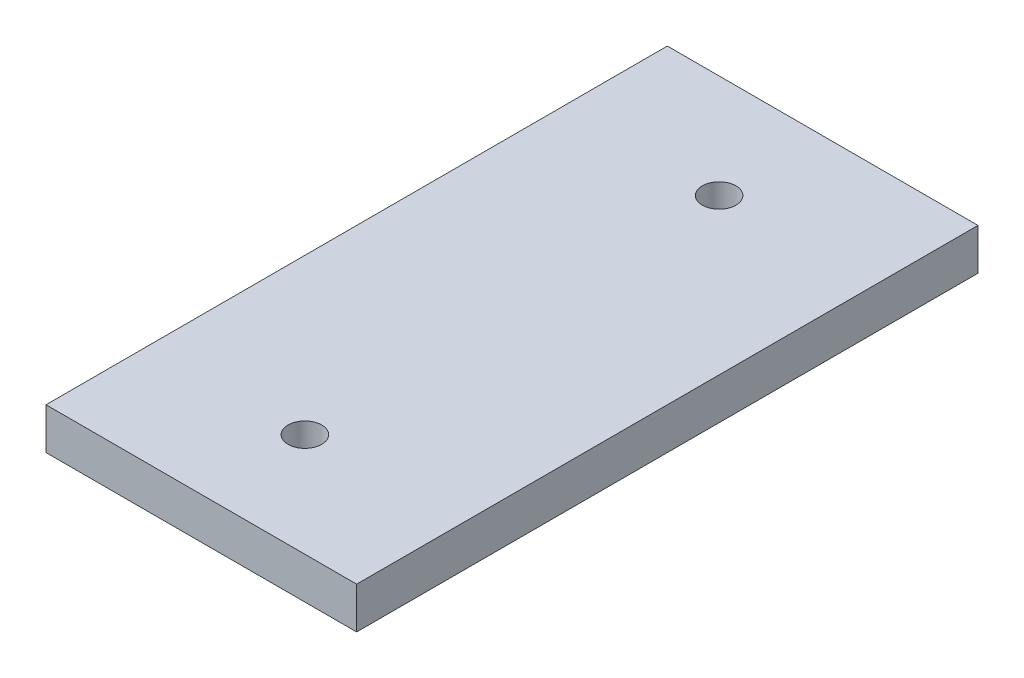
from build123d import *

# Parameters (mm, degrees)
ESQUISSE1_W             = 60
ESQUISSE1_H             = 8
BASE_EXTRUSION_DEPTH    = 120
ESQUISSE2_R             = 3.25
ENL_V_MAT_EXTRU_1_DEPTH = 10


with BuildPart() as part:
    # Esquisse1 → Base-Extrusion (new body)
    with BuildSketch(Plane.XY):
        with Locations((30, -4)):
            Rectangle(ESQUISSE1_W, ESQUISSE1_H)
    extrude(amount=BASE_EXTRUSION_DEPTH)

    # Esquisse2 → Enl_v. mat.-Extru.1 (cut)
    with BuildSketch(Plane(origin=(0, 0, 0), x_dir=(-1, 0, 0), z_dir=(0, 1, 0))):
        with Locations(Location((-30, 100, 0), (0, 0, 90))):
            Circle(ESQUISSE2_R)
        with Locations(Location((-30, 20, 0), (0, 0, 90))):
            Circle(ESQUISSE2_R)
    extrude(amount=-ENL_V_MAT_EXTRU_1_DEPTH, mode=Mode.SUBTRACT)


solid = part.part
